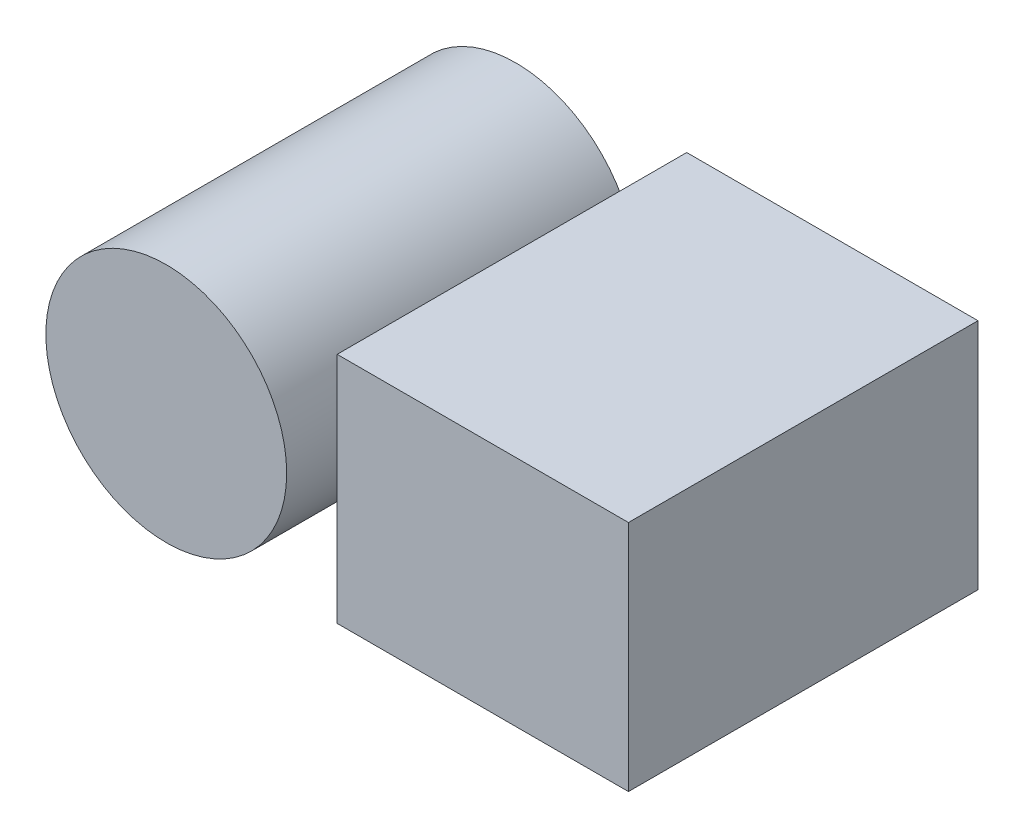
ISO-10303-21;
HEADER;
FILE_DESCRIPTION(('STEP AP214'),'2;1');
FILE_NAME('part.step','',(''),(''),'','','');
FILE_SCHEMA(('AUTOMOTIVE_DESIGN { 1 0 10303 214 1 1 1 1 }'));
ENDSEC;
DATA;
#1=APPLICATION_CONTEXT('core data for automotive mechanical design processes');
#2=APPLICATION_PROTOCOL_DEFINITION('international standard','automotive_design',2000,#1);
#3=PRODUCT_CONTEXT('',#1,'mechanical');
#4=PRODUCT('Part','Part','',(#3));
#5=PRODUCT_RELATED_PRODUCT_CATEGORY('part','',(#4));
#6=PRODUCT_DEFINITION_FORMATION('','',#4);
#7=PRODUCT_DEFINITION_CONTEXT('part definition',#1,'design');
#8=PRODUCT_DEFINITION('design','',#6,#7);
#9=PRODUCT_DEFINITION_SHAPE('','',#8);
#10=(LENGTH_UNIT() NAMED_UNIT(*) SI_UNIT(.MILLI.,.METRE.));
#11=(NAMED_UNIT(*) PLANE_ANGLE_UNIT() SI_UNIT($,.RADIAN.));
#12=(NAMED_UNIT(*) SI_UNIT($,.STERADIAN.) SOLID_ANGLE_UNIT());
#13=UNCERTAINTY_MEASURE_WITH_UNIT(LENGTH_MEASURE(1.E-05),#10,'distance_accuracy_value','');
#14=(GEOMETRIC_REPRESENTATION_CONTEXT(3) GLOBAL_UNCERTAINTY_ASSIGNED_CONTEXT((#13)) GLOBAL_UNIT_ASSIGNED_CONTEXT((#10,
#11,#12)) REPRESENTATION_CONTEXT('',''));
#15=CARTESIAN_POINT('',(0.,0.,0.));
#16=DIRECTION('',(0.,0.,1.));
#17=DIRECTION('',(1.,0.,0.));
#18=AXIS2_PLACEMENT_3D('',#15,#16,#17);
#19=CARTESIAN_POINT('',(-21.4501527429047,38.1200326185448,9.));
#20=DIRECTION('',(-1.,0.,0.));
#21=DIRECTION('',(0.,0.,1.));
#22=AXIS2_PLACEMENT_3D('',#19,#20,#21);
#23=PLANE('',#22);
#24=DIRECTION('',(0.,1.,0.));
#25=VECTOR('',#24,1.);
#26=CARTESIAN_POINT('',(-21.4501527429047,38.1200326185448,0.));
#27=LINE('',#26,#25);
#28=CARTESIAN_POINT('',(-21.4501527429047,32.1200326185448,0.));
#29=VERTEX_POINT('',#28);
#30=CARTESIAN_POINT('',(-21.4501527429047,38.1200326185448,0.));
#31=VERTEX_POINT('',#30);
#32=EDGE_CURVE('P0_E80',#29,#31,#27,.T.);
#33=ORIENTED_EDGE('',*,*,#32,.T.);
#34=DIRECTION('',(0.,0.,-1.));
#35=VECTOR('',#34,1.);
#36=CARTESIAN_POINT('',(-21.4501527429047,38.1200326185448,9.));
#37=LINE('',#36,#35);
#38=CARTESIAN_POINT('',(-21.4501527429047,38.1200326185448,9.));
#39=VERTEX_POINT('',#38);
#40=EDGE_CURVE('P0_E11',#39,#31,#37,.T.);
#41=ORIENTED_EDGE('',*,*,#40,.F.);
#42=DIRECTION('',(0.,1.,0.));
#43=VECTOR('',#42,1.);
#44=CARTESIAN_POINT('',(-21.4501527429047,38.1200326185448,9.));
#45=LINE('',#44,#43);
#46=CARTESIAN_POINT('',(-21.4501527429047,32.1200326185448,9.));
#47=VERTEX_POINT('',#46);
#48=EDGE_CURVE('P0_E68',#47,#39,#45,.T.);
#49=ORIENTED_EDGE('',*,*,#48,.F.);
#50=DIRECTION('',(0.,0.,-1.));
#51=VECTOR('',#50,1.);
#52=CARTESIAN_POINT('',(-21.4501527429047,32.1200326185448,9.));
#53=LINE('',#52,#51);
#54=EDGE_CURVE('P0_E76',#47,#29,#53,.T.);
#55=ORIENTED_EDGE('',*,*,#54,.T.);
#56=EDGE_LOOP('',(#33,#41,#49,#55));
#57=FACE_BOUND('',#56,.T.);
#58=ADVANCED_FACE('P0_F17',(#57),#23,.F.);
#59=CARTESIAN_POINT('',(-21.4501527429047,38.1200326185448,9.));
#60=DIRECTION('',(0.,-1.,0.));
#61=DIRECTION('',(0.,0.,-1.));
#62=AXIS2_PLACEMENT_3D('',#59,#60,#61);
#63=PLANE('',#62);
#64=DIRECTION('',(-1.,0.,0.));
#65=VECTOR('',#64,1.);
#66=CARTESIAN_POINT('',(-21.4501527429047,38.1200326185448,0.));
#67=LINE('',#66,#65);
#68=CARTESIAN_POINT('',(-28.9501527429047,38.1200326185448,0.));
#69=VERTEX_POINT('',#68);
#70=EDGE_CURVE('P0_E72',#31,#69,#67,.T.);
#71=ORIENTED_EDGE('',*,*,#70,.T.);
#72=DIRECTION('',(0.,0.,-1.));
#73=VECTOR('',#72,1.);
#74=CARTESIAN_POINT('',(-28.9501527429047,38.1200326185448,9.));
#75=LINE('',#74,#73);
#76=CARTESIAN_POINT('',(-28.9501527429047,38.1200326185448,9.));
#77=VERTEX_POINT('',#76);
#78=EDGE_CURVE('P0_E25',#77,#69,#75,.T.);
#79=ORIENTED_EDGE('',*,*,#78,.F.);
#80=DIRECTION('',(-1.,0.,0.));
#81=VECTOR('',#80,1.);
#82=CARTESIAN_POINT('',(-21.4501527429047,38.1200326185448,9.));
#83=LINE('',#82,#81);
#84=EDGE_CURVE('P0_E63',#39,#77,#83,.T.);
#85=ORIENTED_EDGE('',*,*,#84,.F.);
#86=ORIENTED_EDGE('',*,*,#40,.T.);
#87=EDGE_LOOP('',(#71,#79,#85,#86));
#88=FACE_BOUND('',#87,.T.);
#89=ADVANCED_FACE('P0_F71',(#88),#63,.F.);
#90=CARTESIAN_POINT('',(-28.9501527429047,38.1200326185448,9.));
#91=DIRECTION('',(1.,0.,0.));
#92=DIRECTION('',(0.,1.,0.));
#93=AXIS2_PLACEMENT_3D('',#90,#91,#92);
#94=PLANE('',#93);
#95=DIRECTION('',(0.,-1.,0.));
#96=VECTOR('',#95,1.);
#97=CARTESIAN_POINT('',(-28.9501527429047,38.1200326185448,0.));
#98=LINE('',#97,#96);
#99=CARTESIAN_POINT('',(-28.9501527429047,32.1200326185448,0.));
#100=VERTEX_POINT('',#99);
#101=EDGE_CURVE('P0_E50',#69,#100,#98,.T.);
#102=ORIENTED_EDGE('',*,*,#101,.T.);
#103=DIRECTION('',(0.,0.,-1.));
#104=VECTOR('',#103,1.);
#105=CARTESIAN_POINT('',(-28.9501527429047,32.1200326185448,9.));
#106=LINE('',#105,#104);
#107=CARTESIAN_POINT('',(-28.9501527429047,32.1200326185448,9.));
#108=VERTEX_POINT('',#107);
#109=EDGE_CURVE('P0_E73',#108,#100,#106,.T.);
#110=ORIENTED_EDGE('',*,*,#109,.F.);
#111=DIRECTION('',(0.,-1.,0.));
#112=VECTOR('',#111,1.);
#113=CARTESIAN_POINT('',(-28.9501527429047,38.1200326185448,9.));
#114=LINE('',#113,#112);
#115=EDGE_CURVE('P0_E66',#77,#108,#114,.T.);
#116=ORIENTED_EDGE('',*,*,#115,.F.);
#117=ORIENTED_EDGE('',*,*,#78,.T.);
#118=EDGE_LOOP('',(#102,#110,#116,#117));
#119=FACE_BOUND('',#118,.T.);
#120=ADVANCED_FACE('P0_F74',(#119),#94,.F.);
#121=CARTESIAN_POINT('',(-21.4501527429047,32.1200326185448,9.));
#122=DIRECTION('',(0.,1.,0.));
#123=DIRECTION('',(-1.,0.,0.));
#124=AXIS2_PLACEMENT_3D('',#121,#122,#123);
#125=PLANE('',#124);
#126=DIRECTION('',(1.,0.,0.));
#127=VECTOR('',#126,1.);
#128=CARTESIAN_POINT('',(-21.4501527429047,32.1200326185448,0.));
#129=LINE('',#128,#127);
#130=EDGE_CURVE('P0_E56',#100,#29,#129,.T.);
#131=ORIENTED_EDGE('',*,*,#130,.T.);
#132=ORIENTED_EDGE('',*,*,#54,.F.);
#133=DIRECTION('',(1.,0.,0.));
#134=VECTOR('',#133,1.);
#135=CARTESIAN_POINT('',(-21.4501527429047,32.1200326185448,9.));
#136=LINE('',#135,#134);
#137=EDGE_CURVE('P0_E33',#108,#47,#136,.T.);
#138=ORIENTED_EDGE('',*,*,#137,.F.);
#139=ORIENTED_EDGE('',*,*,#109,.T.);
#140=EDGE_LOOP('',(#131,#132,#138,#139));
#141=FACE_BOUND('',#140,.T.);
#142=ADVANCED_FACE('P0_F87',(#141),#125,.F.);
#143=CARTESIAN_POINT('',(0.,0.,9.));
#144=DIRECTION('',(0.,0.,-1.));
#145=DIRECTION('',(-1.,0.,0.));
#146=AXIS2_PLACEMENT_3D('',#143,#144,#145);
#147=PLANE('',#146);
#148=ORIENTED_EDGE('',*,*,#48,.T.);
#149=ORIENTED_EDGE('',*,*,#84,.T.);
#150=ORIENTED_EDGE('',*,*,#115,.T.);
#151=ORIENTED_EDGE('',*,*,#137,.T.);
#152=EDGE_LOOP('',(#148,#149,#150,#151));
#153=FACE_BOUND('',#152,.T.);
#154=ADVANCED_FACE('P0_F64',(#153),#147,.F.);
#155=CARTESIAN_POINT('',(0.,0.,0.));
#156=DIRECTION('',(0.,0.,-1.));
#157=DIRECTION('',(-1.,0.,0.));
#158=AXIS2_PLACEMENT_3D('',#155,#156,#157);
#159=PLANE('',#158);
#160=ORIENTED_EDGE('',*,*,#32,.F.);
#161=ORIENTED_EDGE('',*,*,#130,.F.);
#162=ORIENTED_EDGE('',*,*,#101,.F.);
#163=ORIENTED_EDGE('',*,*,#70,.F.);
#164=EDGE_LOOP('',(#160,#161,#162,#163));
#165=FACE_BOUND('',#164,.T.);
#166=ADVANCED_FACE('P0_F90',(#165),#159,.T.);
#167=CLOSED_SHELL('',(#58,#89,#120,#142,#154,#166));
#168=MANIFOLD_SOLID_BREP('P0_B1',#167);
#169=CARTESIAN_POINT('',(-33.3501527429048,34.8200326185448,9.));
#170=DIRECTION('',(0.,0.,-1.));
#171=DIRECTION('',(-1.,0.,0.));
#172=AXIS2_PLACEMENT_3D('',#169,#170,#171);
#173=CYLINDRICAL_SURFACE('',#172,3.1);
#174=CARTESIAN_POINT('',(-33.3501527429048,34.8200326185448,9.));
#175=DIRECTION('',(0.,0.,1.));
#176=DIRECTION('',(1.,0.,0.));
#177=AXIS2_PLACEMENT_3D('',#174,#175,#176);
#178=CIRCLE('',#177,3.1);
#179=CARTESIAN_POINT('',(-30.2501527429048,34.8200326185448,9.));
#180=VERTEX_POINT('',#179);
#181=EDGE_CURVE('P1_E10',#180,#180,#178,.T.);
#182=ORIENTED_EDGE('',*,*,#181,.F.);
#183=EDGE_LOOP('',(#182));
#184=FACE_BOUND('',#183,.T.);
#185=CARTESIAN_POINT('',(-33.3501527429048,34.8200326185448,0.));
#186=DIRECTION('',(0.,0.,1.));
#187=DIRECTION('',(1.,0.,0.));
#188=AXIS2_PLACEMENT_3D('',#185,#186,#187);
#189=CIRCLE('',#188,3.1);
#190=CARTESIAN_POINT('',(-30.2501527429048,34.8200326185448,0.));
#191=VERTEX_POINT('',#190);
#192=EDGE_CURVE('P1_E18',#191,#191,#189,.T.);
#193=ORIENTED_EDGE('',*,*,#192,.T.);
#194=EDGE_LOOP('',(#193));
#195=FACE_BOUND('',#194,.T.);
#196=ADVANCED_FACE('P1_F15',(#184,#195),#173,.T.);
#197=CARTESIAN_POINT('',(-33.3501527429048,34.8200326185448,9.));
#198=DIRECTION('',(0.,0.,1.));
#199=DIRECTION('',(1.,0.,0.));
#200=AXIS2_PLACEMENT_3D('',#197,#198,#199);
#201=PLANE('',#200);
#202=ORIENTED_EDGE('',*,*,#181,.T.);
#203=EDGE_LOOP('',(#202));
#204=FACE_BOUND('',#203,.T.);
#205=ADVANCED_FACE('P1_F30',(#204),#201,.T.);
#206=CARTESIAN_POINT('',(-33.3501527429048,34.8200326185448,0.));
#207=DIRECTION('',(0.,0.,1.));
#208=DIRECTION('',(1.,0.,0.));
#209=AXIS2_PLACEMENT_3D('',#206,#207,#208);
#210=PLANE('',#209);
#211=ORIENTED_EDGE('',*,*,#192,.F.);
#212=EDGE_LOOP('',(#211));
#213=FACE_BOUND('',#212,.T.);
#214=ADVANCED_FACE('P1_F28',(#213),#210,.F.);
#215=CLOSED_SHELL('',(#196,#205,#214));
#216=MANIFOLD_SOLID_BREP('P1_B1',#215);
#217=ADVANCED_BREP_SHAPE_REPRESENTATION('',(#18,#168,#216),#14);
#218=SHAPE_DEFINITION_REPRESENTATION(#9,#217);
ENDSEC;
END-ISO-10303-21;
